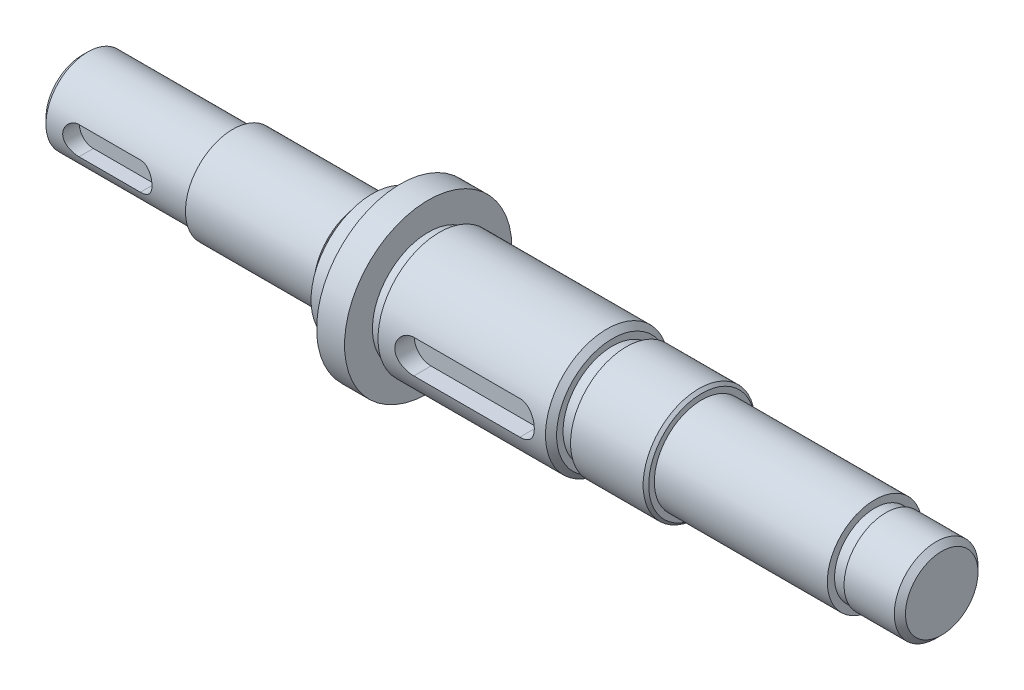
ISO-10303-21;
HEADER;
FILE_DESCRIPTION(('STEP AP214'),'2;1');
FILE_NAME('part.step','',(''),(''),'','','');
FILE_SCHEMA(('AUTOMOTIVE_DESIGN { 1 0 10303 214 1 1 1 1 }'));
ENDSEC;
DATA;
#1=APPLICATION_CONTEXT('core data for automotive mechanical design processes');
#2=APPLICATION_PROTOCOL_DEFINITION('international standard','automotive_design',2000,#1);
#3=PRODUCT_CONTEXT('',#1,'mechanical');
#4=PRODUCT('Part','Part','',(#3));
#5=PRODUCT_RELATED_PRODUCT_CATEGORY('part','',(#4));
#6=PRODUCT_DEFINITION_FORMATION('','',#4);
#7=PRODUCT_DEFINITION_CONTEXT('part definition',#1,'design');
#8=PRODUCT_DEFINITION('design','',#6,#7);
#9=PRODUCT_DEFINITION_SHAPE('','',#8);
#10=(LENGTH_UNIT() NAMED_UNIT(*) SI_UNIT(.MILLI.,.METRE.));
#11=(NAMED_UNIT(*) PLANE_ANGLE_UNIT() SI_UNIT($,.RADIAN.));
#12=(NAMED_UNIT(*) SI_UNIT($,.STERADIAN.) SOLID_ANGLE_UNIT());
#13=UNCERTAINTY_MEASURE_WITH_UNIT(LENGTH_MEASURE(1.E-05),#10,'distance_accuracy_value','');
#14=(GEOMETRIC_REPRESENTATION_CONTEXT(3) GLOBAL_UNCERTAINTY_ASSIGNED_CONTEXT((#13)) GLOBAL_UNIT_ASSIGNED_CONTEXT((#10,
#11,#12)) REPRESENTATION_CONTEXT('',''));
#15=CARTESIAN_POINT('',(0.,0.,0.));
#16=DIRECTION('',(0.,0.,1.));
#17=DIRECTION('',(1.,0.,0.));
#18=AXIS2_PLACEMENT_3D('',#15,#16,#17);
#19=CARTESIAN_POINT('',(142.,0.,0.));
#20=DIRECTION('',(1.,0.,0.));
#21=DIRECTION('',(0.,0.,-1.));
#22=AXIS2_PLACEMENT_3D('',#19,#20,#21);
#23=PLANE('',#22);
#24=CARTESIAN_POINT('',(142.,0.,0.));
#25=DIRECTION('',(1.,0.,0.));
#26=DIRECTION('',(0.,0.,-1.));
#27=AXIS2_PLACEMENT_3D('',#24,#25,#26);
#28=CIRCLE('',#27,8.5);
#29=CARTESIAN_POINT('',(142.,0.,-8.5));
#30=VERTEX_POINT('',#29);
#31=EDGE_CURVE('E159',#30,#30,#28,.T.);
#32=ORIENTED_EDGE('',*,*,#31,.T.);
#33=EDGE_LOOP('',(#32));
#34=FACE_BOUND('',#33,.T.);
#35=CARTESIAN_POINT('',(142.,0.,0.));
#36=DIRECTION('',(1.,0.,0.));
#37=DIRECTION('',(0.,0.,-1.));
#38=AXIS2_PLACEMENT_3D('',#35,#36,#37);
#39=CIRCLE('',#38,7.2);
#40=CARTESIAN_POINT('',(142.,0.,-7.2));
#41=VERTEX_POINT('',#40);
#42=EDGE_CURVE('E152',#41,#41,#39,.T.);
#43=ORIENTED_EDGE('',*,*,#42,.F.);
#44=EDGE_LOOP('',(#43));
#45=FACE_BOUND('',#44,.T.);
#46=ADVANCED_FACE('F30',(#34,#45),#23,.T.);
#47=CARTESIAN_POINT('',(111.,0.,0.));
#48=DIRECTION('',(1.,0.,0.));
#49=DIRECTION('',(0.,0.,-1.));
#50=AXIS2_PLACEMENT_3D('',#47,#48,#49);
#51=PLANE('',#50);
#52=CARTESIAN_POINT('',(111.,0.,0.));
#53=DIRECTION('',(1.,0.,0.));
#54=DIRECTION('',(0.,0.,-1.));
#55=AXIS2_PLACEMENT_3D('',#52,#53,#54);
#56=CIRCLE('',#55,9.50000000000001);
#57=CARTESIAN_POINT('',(111.,0.,-9.50000000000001));
#58=VERTEX_POINT('',#57);
#59=EDGE_CURVE('E352',#58,#58,#56,.T.);
#60=ORIENTED_EDGE('',*,*,#59,.T.);
#61=EDGE_LOOP('',(#60));
#62=FACE_BOUND('',#61,.T.);
#63=CARTESIAN_POINT('',(111.,0.,0.));
#64=DIRECTION('',(1.,0.,0.));
#65=DIRECTION('',(0.,0.,-1.));
#66=AXIS2_PLACEMENT_3D('',#63,#64,#65);
#67=CIRCLE('',#66,8.5);
#68=CARTESIAN_POINT('',(111.,0.,-8.5));
#69=VERTEX_POINT('',#68);
#70=EDGE_CURVE('E156',#69,#69,#67,.T.);
#71=ORIENTED_EDGE('',*,*,#70,.F.);
#72=EDGE_LOOP('',(#71));
#73=FACE_BOUND('',#72,.T.);
#74=ADVANCED_FACE('F261',(#62,#73),#51,.T.);
#75=CARTESIAN_POINT('',(95.,0.,0.));
#76=DIRECTION('',(1.,0.,0.));
#77=DIRECTION('',(0.,0.,-1.));
#78=AXIS2_PLACEMENT_3D('',#75,#76,#77);
#79=PLANE('',#78);
#80=CARTESIAN_POINT('',(95.,0.,0.));
#81=DIRECTION('',(1.,0.,0.));
#82=DIRECTION('',(0.,0.,-1.));
#83=AXIS2_PLACEMENT_3D('',#80,#81,#82);
#84=CIRCLE('',#83,9.99999999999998);
#85=CARTESIAN_POINT('',(95.,0.,-9.99999999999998));
#86=VERTEX_POINT('',#85);
#87=EDGE_CURVE('E346',#86,#86,#84,.T.);
#88=ORIENTED_EDGE('',*,*,#87,.T.);
#89=EDGE_LOOP('',(#88));
#90=FACE_BOUND('',#89,.T.);
#91=CARTESIAN_POINT('',(95.,0.,0.));
#92=DIRECTION('',(1.,0.,0.));
#93=DIRECTION('',(0.,0.,-1.));
#94=AXIS2_PLACEMENT_3D('',#91,#92,#93);
#95=CIRCLE('',#94,8.85);
#96=CARTESIAN_POINT('',(95.,0.,-8.85));
#97=VERTEX_POINT('',#96);
#98=EDGE_CURVE('E167',#97,#97,#95,.T.);
#99=ORIENTED_EDGE('',*,*,#98,.F.);
#100=EDGE_LOOP('',(#99));
#101=FACE_BOUND('',#100,.T.);
#102=ADVANCED_FACE('F269',(#90,#101),#79,.T.);
#103=CARTESIAN_POINT('',(62.,0.,0.));
#104=DIRECTION('',(1.,0.,0.));
#105=DIRECTION('',(0.,0.,-1.));
#106=AXIS2_PLACEMENT_3D('',#103,#104,#105);
#107=PLANE('',#106);
#108=CARTESIAN_POINT('',(62.,0.,0.));
#109=DIRECTION('',(1.,0.,0.));
#110=DIRECTION('',(0.,0.,-1.));
#111=AXIS2_PLACEMENT_3D('',#108,#109,#110);
#112=CIRCLE('',#111,15.);
#113=CARTESIAN_POINT('',(62.,0.,-15.));
#114=VERTEX_POINT('',#113);
#115=EDGE_CURVE('E183',#114,#114,#112,.T.);
#116=ORIENTED_EDGE('',*,*,#115,.T.);
#117=EDGE_LOOP('',(#116));
#118=FACE_BOUND('',#117,.T.);
#119=CARTESIAN_POINT('',(62.,0.,0.));
#120=DIRECTION('',(1.,0.,0.));
#121=DIRECTION('',(0.,0.,-1.));
#122=AXIS2_PLACEMENT_3D('',#119,#120,#121);
#123=CIRCLE('',#122,10.);
#124=CARTESIAN_POINT('',(62.,0.,-10.));
#125=VERTEX_POINT('',#124);
#126=EDGE_CURVE('E176',#125,#125,#123,.T.);
#127=ORIENTED_EDGE('',*,*,#126,.F.);
#128=EDGE_LOOP('',(#127));
#129=FACE_BOUND('',#128,.T.);
#130=ADVANCED_FACE('F285',(#118,#129),#107,.T.);
#131=CARTESIAN_POINT('',(50.,0.,0.));
#132=DIRECTION('',(1.,0.,0.));
#133=DIRECTION('',(0.,0.,-1.));
#134=AXIS2_PLACEMENT_3D('',#131,#132,#133);
#135=PLANE('',#134);
#136=CARTESIAN_POINT('',(50.,0.,0.));
#137=DIRECTION('',(1.,0.,0.));
#138=DIRECTION('',(0.,0.,-1.));
#139=AXIS2_PLACEMENT_3D('',#136,#137,#138);
#140=CIRCLE('',#139,8.5);
#141=CARTESIAN_POINT('',(50.,0.,-8.5));
#142=VERTEX_POINT('',#141);
#143=EDGE_CURVE('E201',#142,#142,#140,.T.);
#144=ORIENTED_EDGE('',*,*,#143,.T.);
#145=EDGE_LOOP('',(#144));
#146=FACE_BOUND('',#145,.T.);
#147=CARTESIAN_POINT('',(50.,0.,0.));
#148=DIRECTION('',(1.,0.,0.));
#149=DIRECTION('',(0.,0.,-1.));
#150=AXIS2_PLACEMENT_3D('',#147,#148,#149);
#151=CIRCLE('',#150,8.2);
#152=CARTESIAN_POINT('',(50.,0.,-8.2));
#153=VERTEX_POINT('',#152);
#154=EDGE_CURVE('E192',#153,#153,#151,.T.);
#155=ORIENTED_EDGE('',*,*,#154,.F.);
#156=EDGE_LOOP('',(#155));
#157=FACE_BOUND('',#156,.T.);
#158=ADVANCED_FACE('F485',(#146,#157),#135,.T.);
#159=CARTESIAN_POINT('',(27.,0.,0.));
#160=DIRECTION('',(-1.,0.,0.));
#161=DIRECTION('',(0.,0.,1.));
#162=AXIS2_PLACEMENT_3D('',#159,#160,#161);
#163=CYLINDRICAL_SURFACE('',#162,7.5);
#164=CARTESIAN_POINT('',(0.99999999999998,0.,0.));
#165=DIRECTION('',(1.,0.,0.));
#166=DIRECTION('',(0.,0.,-1.));
#167=AXIS2_PLACEMENT_3D('',#164,#165,#166);
#168=CIRCLE('',#167,7.5);
#169=CARTESIAN_POINT('',(0.99999999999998,0.,-7.5));
#170=VERTEX_POINT('',#169);
#171=EDGE_CURVE('E332',#170,#170,#168,.T.);
#172=ORIENTED_EDGE('',*,*,#171,.T.);
#173=EDGE_LOOP('',(#172));
#174=FACE_BOUND('',#173,.T.);
#175=DIRECTION('',(-1.,0.,0.));
#176=VECTOR('',#175,1.);
#177=CARTESIAN_POINT('',(27.,2.5,7.07106781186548));
#178=LINE('',#177,#176);
#179=CARTESIAN_POINT('',(6.5,2.5,7.07106781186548));
#180=VERTEX_POINT('',#179);
#181=CARTESIAN_POINT('',(17.5,2.5,7.07106781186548));
#182=VERTEX_POINT('',#181);
#183=EDGE_CURVE('E330',#180,#182,#178,.F.);
#184=ORIENTED_EDGE('',*,*,#183,.T.);
#185=CARTESIAN_POINT('',(17.5,2.5,7.07106781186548));
#186=CARTESIAN_POINT('',(17.5682070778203,2.50000899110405,7.07105693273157));
#187=CARTESIAN_POINT('',(17.6364080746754,2.49720887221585,7.07205443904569));
#188=CARTESIAN_POINT('',(17.7722810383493,2.4860604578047,7.07598524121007));
#189=CARTESIAN_POINT('',(17.8399531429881,2.47771365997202,7.07891801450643));
#190=CARTESIAN_POINT('',(17.9740904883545,2.45557459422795,7.08662705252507));
#191=CARTESIAN_POINT('',(18.0405587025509,2.44179847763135,7.09139784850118));
#192=CARTESIAN_POINT('',(18.1720082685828,2.4089418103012,7.10262619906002));
#193=CARTESIAN_POINT('',(18.2369895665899,2.38986106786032,7.10908381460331));
#194=CARTESIAN_POINT('',(18.4289615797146,2.32491551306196,7.13069940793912));
#195=CARTESIAN_POINT('',(18.55317915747,2.2713141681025,7.14811243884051));
#196=CARTESIAN_POINT('',(18.7908768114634,2.14517784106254,7.1869703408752));
#197=CARTESIAN_POINT('',(18.9043502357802,2.07263123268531,7.20841768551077));
#198=CARTESIAN_POINT('',(19.1217929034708,1.90762995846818,7.25386182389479));
#199=CARTESIAN_POINT('',(19.2252851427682,1.81456284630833,7.27792189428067));
#200=CARTESIAN_POINT('',(19.4155171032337,1.61247071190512,7.32534626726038));
#201=CARTESIAN_POINT('',(19.502253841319,1.50344285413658,7.34871044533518));
#202=CARTESIAN_POINT('',(19.6586982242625,1.26900922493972,7.39284706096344));
#203=CARTESIAN_POINT('',(19.7279023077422,1.14325025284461,7.41353593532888));
#204=CARTESIAN_POINT('',(19.8439807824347,0.881073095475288,7.44924021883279));
#205=CARTESIAN_POINT('',(19.8908619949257,0.744658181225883,7.46425736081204));
#206=CARTESIAN_POINT('',(19.9593392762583,0.470073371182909,7.48647677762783));
#207=CARTESIAN_POINT('',(19.9817581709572,0.332129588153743,7.49393272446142));
#208=CARTESIAN_POINT('',(20.0032907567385,0.0542474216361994,7.50109021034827));
#209=CARTESIAN_POINT('',(20.0024100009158,-0.0856904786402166,7.50079359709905));
#210=CARTESIAN_POINT('',(19.9778892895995,-0.357759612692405,7.49265096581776));
#211=CARTESIAN_POINT('',(19.9551434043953,-0.489981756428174,7.48510152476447));
#212=CARTESIAN_POINT('',(19.8890170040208,-0.748610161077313,7.46367401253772));
#213=CARTESIAN_POINT('',(19.8456353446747,-0.875016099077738,7.44979559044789));
#214=CARTESIAN_POINT('',(19.7389465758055,-1.12038155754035,7.41689170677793));
#215=CARTESIAN_POINT('',(19.6753848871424,-1.23922126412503,7.39780094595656));
#216=CARTESIAN_POINT('',(19.530350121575,-1.46481147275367,7.35645969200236));
#217=CARTESIAN_POINT('',(19.4488721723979,-1.57155867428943,7.33420833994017));
#218=CARTESIAN_POINT('',(19.2658223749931,-1.77524334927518,7.28765679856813));
#219=CARTESIAN_POINT('',(19.1634861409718,-1.87148402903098,7.26330946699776));
#220=CARTESIAN_POINT('',(18.9438962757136,-2.04568006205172,7.21618726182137));
#221=CARTESIAN_POINT('',(18.826637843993,-2.12362950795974,7.19341289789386));
#222=CARTESIAN_POINT('',(18.5782995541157,-2.26000831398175,7.15175078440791));
#223=CARTESIAN_POINT('',(18.4470412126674,-2.31813252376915,7.13292537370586));
#224=CARTESIAN_POINT('',(18.1758825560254,-2.41115057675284,7.10202742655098));
#225=CARTESIAN_POINT('',(18.0359962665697,-2.4460810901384,7.08994423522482));
#226=CARTESIAN_POINT('',(17.82895340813,-2.47914539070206,7.078413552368));
#227=CARTESIAN_POINT('',(17.7633965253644,-2.48696265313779,7.07566669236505));
#228=CARTESIAN_POINT('',(17.6319048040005,-2.49738654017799,7.07199258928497));
#229=CARTESIAN_POINT('',(17.565970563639,-2.49999988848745,7.0710629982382));
#230=CARTESIAN_POINT('',(17.5,-2.5,7.07106781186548));
#231=B_SPLINE_CURVE_WITH_KNOTS('',3,(#185,#186,#187,#188,#189,#190,#191,#192,#193,#194,#195,
#196,#197,#198,#199,#200,#201,#202,#203,#204,#205,#206,#207,#208,#209,#210,#211,#212,#213,#214,
#215,#216,#217,#218,#219,#220,#221,#222,#223,#224,#225,#226,#227,#228,#229,#230),.UNSPECIFIED.,
.F.,.F.,(4,2,2,2,2,2,2,2,2,2,2,2,2,2,2,2,2,2,2,2,2,2,4),(0.,0.204546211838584,0.409037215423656,
0.612924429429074,0.816819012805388,1.22401016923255,1.63145179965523,2.05327864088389,
2.47518051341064,2.90809434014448,3.34087579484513,3.75860278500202,4.17623021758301,
4.57747647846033,4.97874498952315,5.38529148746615,5.79194868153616,6.21771736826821,
6.64362337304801,7.07581676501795,7.50732520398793,7.70536340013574,7.90314555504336),.UNSPECIFIED.);
#232=CARTESIAN_POINT('',(17.5,-2.5,7.07106781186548));
#233=VERTEX_POINT('',#232);
#234=EDGE_CURVE('E209',#182,#233,#231,.T.);
#235=ORIENTED_EDGE('',*,*,#234,.T.);
#236=DIRECTION('',(-1.,0.,0.));
#237=VECTOR('',#236,1.);
#238=CARTESIAN_POINT('',(27.,-2.5,7.07106781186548));
#239=LINE('',#238,#237);
#240=CARTESIAN_POINT('',(6.5,-2.5,7.07106781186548));
#241=VERTEX_POINT('',#240);
#242=EDGE_CURVE('E327',#233,#241,#239,.T.);
#243=ORIENTED_EDGE('',*,*,#242,.T.);
#244=CARTESIAN_POINT('',(6.5,-2.5,7.07106781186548));
#245=CARTESIAN_POINT('',(6.43179292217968,-2.50000899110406,7.07105693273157));
#246=CARTESIAN_POINT('',(6.36359192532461,-2.49720887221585,7.07205443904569));
#247=CARTESIAN_POINT('',(6.22771896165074,-2.4860604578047,7.07598524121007));
#248=CARTESIAN_POINT('',(6.16004685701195,-2.47771365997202,7.07891801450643));
#249=CARTESIAN_POINT('',(6.02590951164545,-2.45557459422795,7.08662705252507));
#250=CARTESIAN_POINT('',(5.95944129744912,-2.44179847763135,7.09139784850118));
#251=CARTESIAN_POINT('',(5.82799173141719,-2.4089418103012,7.10262619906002));
#252=CARTESIAN_POINT('',(5.7630104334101,-2.38986106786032,7.10908381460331));
#253=CARTESIAN_POINT('',(5.57103842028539,-2.32491551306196,7.13069940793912));
#254=CARTESIAN_POINT('',(5.44682084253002,-2.2713141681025,7.14811243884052));
#255=CARTESIAN_POINT('',(5.20912318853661,-2.14517784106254,7.1869703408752));
#256=CARTESIAN_POINT('',(5.09564976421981,-2.07263123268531,7.20841768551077));
#257=CARTESIAN_POINT('',(4.8782070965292,-1.90762995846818,7.25386182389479));
#258=CARTESIAN_POINT('',(4.7747148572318,-1.81456284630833,7.27792189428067));
#259=CARTESIAN_POINT('',(4.58448289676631,-1.61247071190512,7.32534626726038));
#260=CARTESIAN_POINT('',(4.497746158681,-1.50344285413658,7.34871044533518));
#261=CARTESIAN_POINT('',(4.34130177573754,-1.26900922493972,7.39284706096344));
#262=CARTESIAN_POINT('',(4.27209769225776,-1.1432502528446,7.41353593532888));
#263=CARTESIAN_POINT('',(4.1560192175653,-0.881073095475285,7.44924021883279));
#264=CARTESIAN_POINT('',(4.10913800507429,-0.744658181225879,7.46425736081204));
#265=CARTESIAN_POINT('',(4.04066072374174,-0.470073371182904,7.48647677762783));
#266=CARTESIAN_POINT('',(4.01824182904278,-0.332129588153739,7.49393272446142));
#267=CARTESIAN_POINT('',(3.99670924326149,-0.0542474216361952,7.50109021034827));
#268=CARTESIAN_POINT('',(3.99758999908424,0.0856904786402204,7.50079359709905));
#269=CARTESIAN_POINT('',(4.0221107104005,0.357759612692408,7.49265096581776));
#270=CARTESIAN_POINT('',(4.04485659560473,0.489981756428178,7.48510152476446));
#271=CARTESIAN_POINT('',(4.11098299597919,0.748610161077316,7.46367401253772));
#272=CARTESIAN_POINT('',(4.15436465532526,0.875016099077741,7.44979559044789));
#273=CARTESIAN_POINT('',(4.26105342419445,1.12038155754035,7.41689170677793));
#274=CARTESIAN_POINT('',(4.32461511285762,1.23922126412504,7.39780094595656));
#275=CARTESIAN_POINT('',(4.46964987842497,1.46481147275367,7.35645969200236));
#276=CARTESIAN_POINT('',(4.55112782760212,1.57155867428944,7.33420833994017));
#277=CARTESIAN_POINT('',(4.73417762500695,1.77524334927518,7.28765679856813));
#278=CARTESIAN_POINT('',(4.83651385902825,1.87148402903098,7.26330946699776));
#279=CARTESIAN_POINT('',(5.05610372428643,2.04568006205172,7.21618726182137));
#280=CARTESIAN_POINT('',(5.17336215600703,2.12362950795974,7.19341289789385));
#281=CARTESIAN_POINT('',(5.42170044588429,2.26000831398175,7.15175078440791));
#282=CARTESIAN_POINT('',(5.55295878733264,2.31813252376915,7.13292537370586));
#283=CARTESIAN_POINT('',(5.8241174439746,2.41115057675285,7.10202742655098));
#284=CARTESIAN_POINT('',(5.96400373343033,2.4460810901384,7.08994423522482));
#285=CARTESIAN_POINT('',(6.17104659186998,2.47914539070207,7.078413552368));
#286=CARTESIAN_POINT('',(6.23660347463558,2.48696265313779,7.07566669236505));
#287=CARTESIAN_POINT('',(6.36809519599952,2.49738654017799,7.07199258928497));
#288=CARTESIAN_POINT('',(6.43402943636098,2.49999988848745,7.0710629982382));
#289=CARTESIAN_POINT('',(6.5,2.5,7.07106781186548));
#290=B_SPLINE_CURVE_WITH_KNOTS('',3,(#244,#245,#246,#247,#248,#249,#250,#251,#252,#253,#254,
#255,#256,#257,#258,#259,#260,#261,#262,#263,#264,#265,#266,#267,#268,#269,#270,#271,#272,#273,
#274,#275,#276,#277,#278,#279,#280,#281,#282,#283,#284,#285,#286,#287,#288,#289),.UNSPECIFIED.,
.F.,.F.,(4,2,2,2,2,2,2,2,2,2,2,2,2,2,2,2,2,2,2,2,2,2,4),(0.,0.204546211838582,0.409037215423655,
0.612924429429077,0.816819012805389,1.22401016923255,1.63145179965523,2.0532786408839,
2.47518051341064,2.90809434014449,3.34087579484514,3.75860278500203,4.17623021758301,
4.57747647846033,4.97874498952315,5.38529148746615,5.79194868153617,6.21771736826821,
6.64362337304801,7.07581676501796,7.50732520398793,7.70536340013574,7.90314555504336),.UNSPECIFIED.);
#291=EDGE_CURVE('E53',#241,#180,#290,.T.);
#292=ORIENTED_EDGE('',*,*,#291,.T.);
#293=EDGE_LOOP('',(#184,#235,#243,#292));
#294=FACE_BOUND('',#293,.T.);
#295=CARTESIAN_POINT('',(27.,0.,0.));
#296=DIRECTION('',(1.,0.,0.));
#297=DIRECTION('',(0.,0.,-1.));
#298=AXIS2_PLACEMENT_3D('',#295,#296,#297);
#299=CIRCLE('',#298,7.5);
#300=CARTESIAN_POINT('',(27.,0.,-7.5));
#301=VERTEX_POINT('',#300);
#302=EDGE_CURVE('E204',#301,#301,#299,.T.);
#303=ORIENTED_EDGE('',*,*,#302,.F.);
#304=EDGE_LOOP('',(#303));
#305=FACE_BOUND('',#304,.T.);
#306=ADVANCED_FACE('F222',(#174,#294,#305),#163,.T.);
#307=CARTESIAN_POINT('',(0.,0.,0.));
#308=DIRECTION('',(1.,0.,0.));
#309=DIRECTION('',(0.,0.,-1.));
#310=AXIS2_PLACEMENT_3D('',#307,#308,#309);
#311=PLANE('',#310);
#312=CARTESIAN_POINT('',(0.,0.,0.));
#313=DIRECTION('',(1.,0.,0.));
#314=DIRECTION('',(0.,0.,-1.));
#315=AXIS2_PLACEMENT_3D('',#312,#313,#314);
#316=CIRCLE('',#315,6.50000000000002);
#317=CARTESIAN_POINT('',(0.,0.,-6.50000000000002));
#318=VERTEX_POINT('',#317);
#319=EDGE_CURVE('E335',#318,#318,#316,.F.);
#320=ORIENTED_EDGE('',*,*,#319,.T.);
#321=EDGE_LOOP('',(#320));
#322=FACE_BOUND('',#321,.T.);
#323=ADVANCED_FACE('F470',(#322),#311,.F.);
#324=CARTESIAN_POINT('',(27.,0.,0.));
#325=DIRECTION('',(1.,0.,0.));
#326=DIRECTION('',(0.,0.,-1.));
#327=AXIS2_PLACEMENT_3D('',#324,#325,#326);
#328=PLANE('',#327);
#329=CARTESIAN_POINT('',(27.,0.,0.));
#330=DIRECTION('',(1.,0.,0.));
#331=DIRECTION('',(0.,0.,-1.));
#332=AXIS2_PLACEMENT_3D('',#329,#330,#331);
#333=CIRCLE('',#332,8.5);
#334=CARTESIAN_POINT('',(27.,0.,-8.5));
#335=VERTEX_POINT('',#334);
#336=EDGE_CURVE('E198',#335,#335,#333,.T.);
#337=ORIENTED_EDGE('',*,*,#336,.F.);
#338=EDGE_LOOP('',(#337));
#339=FACE_BOUND('',#338,.T.);
#340=ORIENTED_EDGE('',*,*,#302,.T.);
#341=EDGE_LOOP('',(#340));
#342=FACE_BOUND('',#341,.T.);
#343=ADVANCED_FACE('F475',(#339,#342),#328,.F.);
#344=CARTESIAN_POINT('',(50.,0.,0.));
#345=DIRECTION('',(-1.,0.,0.));
#346=DIRECTION('',(0.,0.,1.));
#347=AXIS2_PLACEMENT_3D('',#344,#345,#346);
#348=CYLINDRICAL_SURFACE('',#347,8.5);
#349=ORIENTED_EDGE('',*,*,#143,.F.);
#350=EDGE_LOOP('',(#349));
#351=FACE_BOUND('',#350,.T.);
#352=ORIENTED_EDGE('',*,*,#336,.T.);
#353=EDGE_LOOP('',(#352));
#354=FACE_BOUND('',#353,.T.);
#355=ADVANCED_FACE('F616',(#351,#354),#348,.T.);
#356=CARTESIAN_POINT('',(52.,0.,0.));
#357=DIRECTION('',(-1.,0.,0.));
#358=DIRECTION('',(0.,0.,1.));
#359=AXIS2_PLACEMENT_3D('',#356,#357,#358);
#360=CYLINDRICAL_SURFACE('',#359,8.2);
#361=CARTESIAN_POINT('',(52.,0.,0.));
#362=DIRECTION('',(1.,0.,0.));
#363=DIRECTION('',(0.,0.,-1.));
#364=AXIS2_PLACEMENT_3D('',#361,#362,#363);
#365=CIRCLE('',#364,8.2);
#366=CARTESIAN_POINT('',(52.,0.,-8.2));
#367=VERTEX_POINT('',#366);
#368=EDGE_CURVE('E195',#367,#367,#365,.T.);
#369=ORIENTED_EDGE('',*,*,#368,.F.);
#370=EDGE_LOOP('',(#369));
#371=FACE_BOUND('',#370,.T.);
#372=ORIENTED_EDGE('',*,*,#154,.T.);
#373=EDGE_LOOP('',(#372));
#374=FACE_BOUND('',#373,.T.);
#375=ADVANCED_FACE('F606',(#371,#374),#360,.T.);
#376=CARTESIAN_POINT('',(52.,0.,0.));
#377=DIRECTION('',(1.,0.,0.));
#378=DIRECTION('',(0.,0.,-1.));
#379=AXIS2_PLACEMENT_3D('',#376,#377,#378);
#380=PLANE('',#379);
#381=CARTESIAN_POINT('',(52.,0.,0.));
#382=DIRECTION('',(1.,0.,0.));
#383=DIRECTION('',(0.,0.,-1.));
#384=AXIS2_PLACEMENT_3D('',#381,#382,#383);
#385=CIRCLE('',#384,11.);
#386=CARTESIAN_POINT('',(52.,0.,-11.));
#387=VERTEX_POINT('',#386);
#388=EDGE_CURVE('E186',#387,#387,#385,.T.);
#389=ORIENTED_EDGE('',*,*,#388,.F.);
#390=EDGE_LOOP('',(#389));
#391=FACE_BOUND('',#390,.T.);
#392=ORIENTED_EDGE('',*,*,#368,.T.);
#393=EDGE_LOOP('',(#392));
#394=FACE_BOUND('',#393,.T.);
#395=ADVANCED_FACE('F596',(#391,#394),#380,.F.);
#396=CARTESIAN_POINT('',(57.,0.,0.));
#397=DIRECTION('',(-1.,0.,0.));
#398=DIRECTION('',(0.,0.,1.));
#399=AXIS2_PLACEMENT_3D('',#396,#397,#398);
#400=CYLINDRICAL_SURFACE('',#399,11.);
#401=CARTESIAN_POINT('',(57.,0.,0.));
#402=DIRECTION('',(1.,0.,0.));
#403=DIRECTION('',(0.,0.,-1.));
#404=AXIS2_PLACEMENT_3D('',#401,#402,#403);
#405=CIRCLE('',#404,11.);
#406=CARTESIAN_POINT('',(57.,0.,-11.));
#407=VERTEX_POINT('',#406);
#408=EDGE_CURVE('E189',#407,#407,#405,.T.);
#409=ORIENTED_EDGE('',*,*,#408,.F.);
#410=EDGE_LOOP('',(#409));
#411=FACE_BOUND('',#410,.T.);
#412=ORIENTED_EDGE('',*,*,#388,.T.);
#413=EDGE_LOOP('',(#412));
#414=FACE_BOUND('',#413,.T.);
#415=ADVANCED_FACE('F586',(#411,#414),#400,.T.);
#416=CARTESIAN_POINT('',(57.,0.,0.));
#417=DIRECTION('',(1.,0.,0.));
#418=DIRECTION('',(0.,0.,-1.));
#419=AXIS2_PLACEMENT_3D('',#416,#417,#418);
#420=PLANE('',#419);
#421=CARTESIAN_POINT('',(57.,0.,0.));
#422=DIRECTION('',(1.,0.,0.));
#423=DIRECTION('',(0.,0.,-1.));
#424=AXIS2_PLACEMENT_3D('',#421,#422,#423);
#425=CIRCLE('',#424,15.);
#426=CARTESIAN_POINT('',(57.,0.,-15.));
#427=VERTEX_POINT('',#426);
#428=EDGE_CURVE('E180',#427,#427,#425,.T.);
#429=ORIENTED_EDGE('',*,*,#428,.F.);
#430=EDGE_LOOP('',(#429));
#431=FACE_BOUND('',#430,.T.);
#432=ORIENTED_EDGE('',*,*,#408,.T.);
#433=EDGE_LOOP('',(#432));
#434=FACE_BOUND('',#433,.T.);
#435=ADVANCED_FACE('F576',(#431,#434),#420,.F.);
#436=CARTESIAN_POINT('',(62.,0.,0.));
#437=DIRECTION('',(-1.,0.,0.));
#438=DIRECTION('',(0.,0.,1.));
#439=AXIS2_PLACEMENT_3D('',#436,#437,#438);
#440=CYLINDRICAL_SURFACE('',#439,15.);
#441=ORIENTED_EDGE('',*,*,#115,.F.);
#442=EDGE_LOOP('',(#441));
#443=FACE_BOUND('',#442,.T.);
#444=ORIENTED_EDGE('',*,*,#428,.T.);
#445=EDGE_LOOP('',(#444));
#446=FACE_BOUND('',#445,.T.);
#447=ADVANCED_FACE('F560',(#443,#446),#440,.T.);
#448=CARTESIAN_POINT('',(64.,0.,0.));
#449=DIRECTION('',(-1.,0.,0.));
#450=DIRECTION('',(0.,0.,1.));
#451=AXIS2_PLACEMENT_3D('',#448,#449,#450);
#452=CYLINDRICAL_SURFACE('',#451,10.);
#453=CARTESIAN_POINT('',(64.,0.,0.));
#454=DIRECTION('',(1.,0.,0.));
#455=DIRECTION('',(0.,0.,-1.));
#456=AXIS2_PLACEMENT_3D('',#453,#454,#455);
#457=CIRCLE('',#456,10.);
#458=CARTESIAN_POINT('',(64.,0.,-10.));
#459=VERTEX_POINT('',#458);
#460=EDGE_CURVE('E177',#459,#459,#457,.T.);
#461=ORIENTED_EDGE('',*,*,#460,.F.);
#462=EDGE_LOOP('',(#461));
#463=FACE_BOUND('',#462,.T.);
#464=ORIENTED_EDGE('',*,*,#126,.T.);
#465=EDGE_LOOP('',(#464));
#466=FACE_BOUND('',#465,.T.);
#467=ADVANCED_FACE('F290',(#463,#466),#452,.T.);
#468=CARTESIAN_POINT('',(64.,0.,0.));
#469=DIRECTION('',(1.,0.,0.));
#470=DIRECTION('',(0.,0.,-1.));
#471=AXIS2_PLACEMENT_3D('',#468,#469,#470);
#472=PLANE('',#471);
#473=CARTESIAN_POINT('',(64.,0.,0.));
#474=DIRECTION('',(1.,0.,0.));
#475=DIRECTION('',(0.,0.,-1.));
#476=AXIS2_PLACEMENT_3D('',#473,#474,#475);
#477=CIRCLE('',#476,11.);
#478=CARTESIAN_POINT('',(64.,0.,-11.));
#479=VERTEX_POINT('',#478);
#480=EDGE_CURVE('E171',#479,#479,#477,.T.);
#481=ORIENTED_EDGE('',*,*,#480,.F.);
#482=EDGE_LOOP('',(#481));
#483=FACE_BOUND('',#482,.T.);
#484=ORIENTED_EDGE('',*,*,#460,.T.);
#485=EDGE_LOOP('',(#484));
#486=FACE_BOUND('',#485,.T.);
#487=ADVANCED_FACE('F287',(#483,#486),#472,.F.);
#488=CARTESIAN_POINT('',(95.,0.,0.));
#489=DIRECTION('',(-1.,0.,0.));
#490=DIRECTION('',(0.,0.,1.));
#491=AXIS2_PLACEMENT_3D('',#488,#489,#490);
#492=CYLINDRICAL_SURFACE('',#491,11.);
#493=DIRECTION('',(-1.,0.,0.));
#494=VECTOR('',#493,1.);
#495=CARTESIAN_POINT('',(95.,3.00000000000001,10.5830052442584));
#496=LINE('',#495,#494);
#497=CARTESIAN_POINT('',(70.,3.00000000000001,10.5830052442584));
#498=VERTEX_POINT('',#497);
#499=CARTESIAN_POINT('',(89.,3.00000000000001,10.5830052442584));
#500=VERTEX_POINT('',#499);
#501=EDGE_CURVE('E11',#498,#500,#496,.F.);
#502=ORIENTED_EDGE('',*,*,#501,.T.);
#503=CARTESIAN_POINT('',(89.,3.00000000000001,10.5830052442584));
#504=CARTESIAN_POINT('',(89.0826938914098,3.0000098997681,10.5829949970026));
#505=CARTESIAN_POINT('',(89.165381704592,2.99658102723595,10.5839742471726));
#506=CARTESIAN_POINT('',(89.3301335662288,2.98292268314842,10.5878356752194));
#507=CARTESIAN_POINT('',(89.4121977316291,2.97269452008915,10.5907174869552));
#508=CARTESIAN_POINT('',(89.5749425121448,2.94554459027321,10.598299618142));
#509=CARTESIAN_POINT('',(89.6556257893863,2.92863770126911,10.6029958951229));
#510=CARTESIAN_POINT('',(89.8152032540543,2.8882912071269,10.6140571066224));
#511=CARTESIAN_POINT('',(89.8940974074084,2.8648514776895,10.6204220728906));
#512=CARTESIAN_POINT('',(90.127242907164,2.78500332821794,10.6417494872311));
#513=CARTESIAN_POINT('',(90.2781393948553,2.71903526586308,10.6589535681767));
#514=CARTESIAN_POINT('',(90.5667053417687,2.56365897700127,10.6973836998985));
#515=CARTESIAN_POINT('',(90.704370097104,2.47424245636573,10.7186111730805));
#516=CARTESIAN_POINT('',(90.9662097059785,2.27200424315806,10.7633148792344));
#517=CARTESIAN_POINT('',(91.0899918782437,2.15868225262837,10.7868322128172));
#518=CARTESIAN_POINT('',(91.3170514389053,1.91292298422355,10.8331129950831));
#519=CARTESIAN_POINT('',(91.4203254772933,1.78048258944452,10.8558763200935));
#520=CARTESIAN_POINT('',(91.6050989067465,1.49749198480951,10.8985459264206));
#521=CARTESIAN_POINT('',(91.686203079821,1.34667477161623,10.9183977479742));
#522=CARTESIAN_POINT('',(91.8217484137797,1.03291980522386,10.9525311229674));
#523=CARTESIAN_POINT('',(91.8761955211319,0.869984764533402,10.9668139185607));
#524=CARTESIAN_POINT('',(91.9556017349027,0.540744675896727,10.9879090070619));
#525=CARTESIAN_POINT('',(91.9812343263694,0.374613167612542,10.9948916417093));
#526=CARTESIAN_POINT('',(92.004404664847,0.0402673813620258,11.0011960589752));
#527=CARTESIAN_POINT('',(92.0019467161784,-0.127946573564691,11.0005190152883));
#528=CARTESIAN_POINT('',(91.9694751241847,-0.456980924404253,10.9917041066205));
#529=CARTESIAN_POINT('',(91.9401899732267,-0.617879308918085,10.9837634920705));
#530=CARTESIAN_POINT('',(91.8560747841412,-0.932383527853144,10.9615477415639));
#531=CARTESIAN_POINT('',(91.8012435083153,-1.08598900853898,10.9472722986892));
#532=CARTESIAN_POINT('',(91.667045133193,-1.38338788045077,10.9137016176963));
#533=CARTESIAN_POINT('',(91.5874317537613,-1.52706425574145,10.8943563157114));
#534=CARTESIAN_POINT('',(91.4061201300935,-1.79926098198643,10.8527253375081));
#535=CARTESIAN_POINT('',(91.3044178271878,-1.92777854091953,10.830439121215));
#536=CARTESIAN_POINT('',(91.0779767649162,-2.17034844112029,10.7844948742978));
#537=CARTESIAN_POINT('',(90.952605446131,-2.28380693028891,10.760815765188));
#538=CARTESIAN_POINT('',(90.6843376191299,-2.48826234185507,10.7153886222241));
#539=CARTESIAN_POINT('',(90.541436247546,-2.57925300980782,10.6936411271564));
#540=CARTESIAN_POINT('',(90.240805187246,-2.73667910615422,10.6544469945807));
#541=CARTESIAN_POINT('',(90.0829757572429,-2.80293223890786,10.6370325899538));
#542=CARTESIAN_POINT('',(89.757912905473,-2.90768324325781,10.6088816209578));
#543=CARTESIAN_POINT('',(89.5906940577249,-2.9462229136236,10.598135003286));
#544=CARTESIAN_POINT('',(89.3516455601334,-2.98015870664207,10.588613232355));
#545=CARTESIAN_POINT('',(89.2814835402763,-2.98759962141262,10.5865140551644));
#546=CARTESIAN_POINT('',(89.1408924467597,-2.99751512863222,10.58371035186));
#547=CARTESIAN_POINT('',(89.0704639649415,-2.99999749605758,10.5830036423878));
#548=CARTESIAN_POINT('',(89.,-3.00000000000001,10.5830052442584));
#549=B_SPLINE_CURVE_WITH_KNOTS('',3,(#503,#504,#505,#506,#507,#508,#509,#510,#511,#512,#513,
#514,#515,#516,#517,#518,#519,#520,#521,#522,#523,#524,#525,#526,#527,#528,#529,#530,#531,#532,
#533,#534,#535,#536,#537,#538,#539,#540,#541,#542,#543,#544,#545,#546,#547,#548),.UNSPECIFIED.,
.F.,.F.,(4,2,2,2,2,2,2,2,2,2,2,2,2,2,2,2,2,2,2,2,2,2,4),(0.,0.247994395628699,0.495941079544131,
0.743338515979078,0.99074065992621,1.48499724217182,1.97942888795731,2.4854708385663,
2.99159538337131,3.50622794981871,4.02074566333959,4.52296979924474,5.0251169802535,
5.51402000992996,6.00294672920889,6.4968964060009,6.99093691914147,7.50077286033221,
8.01075056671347,8.52441550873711,9.03730408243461,9.24891043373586,9.46018472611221),.UNSPECIFIED.);
#550=CARTESIAN_POINT('',(89.,-3.00000000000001,10.5830052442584));
#551=VERTEX_POINT('',#550);
#552=EDGE_CURVE('E299',#500,#551,#549,.T.);
#553=ORIENTED_EDGE('',*,*,#552,.T.);
#554=DIRECTION('',(-1.,0.,0.));
#555=VECTOR('',#554,1.);
#556=CARTESIAN_POINT('',(95.,-3.00000000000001,10.5830052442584));
#557=LINE('',#556,#555);
#558=CARTESIAN_POINT('',(70.,-3.00000000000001,10.5830052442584));
#559=VERTEX_POINT('',#558);
#560=EDGE_CURVE('E38',#551,#559,#557,.T.);
#561=ORIENTED_EDGE('',*,*,#560,.T.);
#562=CARTESIAN_POINT('',(70.,-3.00000000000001,10.5830052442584));
#563=CARTESIAN_POINT('',(69.9173061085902,-3.0000098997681,10.5829949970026));
#564=CARTESIAN_POINT('',(69.834618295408,-2.99658102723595,10.5839742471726));
#565=CARTESIAN_POINT('',(69.6698664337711,-2.98292268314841,10.5878356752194));
#566=CARTESIAN_POINT('',(69.5878022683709,-2.97269452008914,10.5907174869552));
#567=CARTESIAN_POINT('',(69.4250574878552,-2.94554459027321,10.598299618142));
#568=CARTESIAN_POINT('',(69.3443742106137,-2.92863770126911,10.6029958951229));
#569=CARTESIAN_POINT('',(69.1847967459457,-2.8882912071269,10.6140571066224));
#570=CARTESIAN_POINT('',(69.1059025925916,-2.8648514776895,10.6204220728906));
#571=CARTESIAN_POINT('',(68.872757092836,-2.78500332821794,10.6417494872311));
#572=CARTESIAN_POINT('',(68.7218606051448,-2.71903526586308,10.6589535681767));
#573=CARTESIAN_POINT('',(68.4332946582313,-2.56365897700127,10.6973836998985));
#574=CARTESIAN_POINT('',(68.295629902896,-2.47424245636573,10.7186111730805));
#575=CARTESIAN_POINT('',(68.0337902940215,-2.27200424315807,10.7633148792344));
#576=CARTESIAN_POINT('',(67.9100081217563,-2.15868225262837,10.7868322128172));
#577=CARTESIAN_POINT('',(67.6829485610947,-1.91292298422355,10.8331129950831));
#578=CARTESIAN_POINT('',(67.5796745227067,-1.78048258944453,10.8558763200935));
#579=CARTESIAN_POINT('',(67.3949010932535,-1.49749198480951,10.8985459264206));
#580=CARTESIAN_POINT('',(67.313796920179,-1.34667477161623,10.9183977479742));
#581=CARTESIAN_POINT('',(67.1782515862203,-1.03291980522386,10.9525311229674));
#582=CARTESIAN_POINT('',(67.1238044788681,-0.869984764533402,10.9668139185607));
#583=CARTESIAN_POINT('',(67.0443982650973,-0.540744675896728,10.9879090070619));
#584=CARTESIAN_POINT('',(67.0187656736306,-0.374613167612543,10.9948916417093));
#585=CARTESIAN_POINT('',(66.995595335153,-0.0402673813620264,11.0011960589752));
#586=CARTESIAN_POINT('',(66.9980532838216,0.127946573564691,11.0005190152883));
#587=CARTESIAN_POINT('',(67.0305248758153,0.456980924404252,10.9917041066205));
#588=CARTESIAN_POINT('',(67.0598100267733,0.617879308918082,10.9837634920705));
#589=CARTESIAN_POINT('',(67.1439252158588,0.932383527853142,10.9615477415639));
#590=CARTESIAN_POINT('',(67.1987564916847,1.08598900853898,10.9472722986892));
#591=CARTESIAN_POINT('',(67.332954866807,1.38338788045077,10.9137016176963));
#592=CARTESIAN_POINT('',(67.4125682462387,1.52706425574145,10.8943563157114));
#593=CARTESIAN_POINT('',(67.5938798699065,1.79926098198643,10.8527253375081));
#594=CARTESIAN_POINT('',(67.6955821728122,1.92777854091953,10.830439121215));
#595=CARTESIAN_POINT('',(67.9220232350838,2.17034844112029,10.7844948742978));
#596=CARTESIAN_POINT('',(68.047394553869,2.28380693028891,10.760815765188));
#597=CARTESIAN_POINT('',(68.3156623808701,2.48826234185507,10.7153886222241));
#598=CARTESIAN_POINT('',(68.458563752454,2.57925300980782,10.6936411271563));
#599=CARTESIAN_POINT('',(68.759194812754,2.73667910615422,10.6544469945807));
#600=CARTESIAN_POINT('',(68.9170242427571,2.80293223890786,10.6370325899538));
#601=CARTESIAN_POINT('',(69.242087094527,2.90768324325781,10.6088816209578));
#602=CARTESIAN_POINT('',(69.4093059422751,2.9462229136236,10.598135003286));
#603=CARTESIAN_POINT('',(69.6483544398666,2.98015870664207,10.588613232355));
#604=CARTESIAN_POINT('',(69.7185164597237,2.98759962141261,10.5865140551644));
#605=CARTESIAN_POINT('',(69.8591075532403,2.99751512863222,10.58371035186));
#606=CARTESIAN_POINT('',(69.9295360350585,2.99999749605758,10.5830036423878));
#607=CARTESIAN_POINT('',(70.,3.00000000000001,10.5830052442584));
#608=B_SPLINE_CURVE_WITH_KNOTS('',3,(#562,#563,#564,#565,#566,#567,#568,#569,#570,#571,#572,
#573,#574,#575,#576,#577,#578,#579,#580,#581,#582,#583,#584,#585,#586,#587,#588,#589,#590,#591,
#592,#593,#594,#595,#596,#597,#598,#599,#600,#601,#602,#603,#604,#605,#606,#607),.UNSPECIFIED.,
.F.,.F.,(4,2,2,2,2,2,2,2,2,2,2,2,2,2,2,2,2,2,2,2,2,2,4),(0.,0.247994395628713,0.495941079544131,
0.743338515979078,0.99074065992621,1.48499724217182,1.97942888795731,2.48547083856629,
2.99159538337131,3.50622794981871,4.02074566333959,4.52296979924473,5.0251169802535,
5.51402000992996,6.00294672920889,6.4968964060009,6.99093691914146,7.50077286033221,
8.01075056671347,8.5244155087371,9.03730408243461,9.24891043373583,9.46018472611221),.UNSPECIFIED.);
#609=EDGE_CURVE('E45',#559,#498,#608,.T.);
#610=ORIENTED_EDGE('',*,*,#609,.T.);
#611=EDGE_LOOP('',(#502,#553,#561,#610));
#612=FACE_BOUND('',#611,.T.);
#613=CARTESIAN_POINT('',(94.,0.,0.));
#614=DIRECTION('',(1.,0.,0.));
#615=DIRECTION('',(0.,0.,-1.));
#616=AXIS2_PLACEMENT_3D('',#613,#614,#615);
#617=CIRCLE('',#616,11.);
#618=CARTESIAN_POINT('',(94.,0.,-11.));
#619=VERTEX_POINT('',#618);
#620=EDGE_CURVE('E349',#619,#619,#617,.F.);
#621=ORIENTED_EDGE('',*,*,#620,.T.);
#622=EDGE_LOOP('',(#621));
#623=FACE_BOUND('',#622,.T.);
#624=ORIENTED_EDGE('',*,*,#480,.T.);
#625=EDGE_LOOP('',(#624));
#626=FACE_BOUND('',#625,.T.);
#627=ADVANCED_FACE('F281',(#612,#623,#626),#492,.T.);
#628=CARTESIAN_POINT('',(97.5,0.,0.));
#629=DIRECTION('',(-1.,0.,0.));
#630=DIRECTION('',(0.,0.,1.));
#631=AXIS2_PLACEMENT_3D('',#628,#629,#630);
#632=CYLINDRICAL_SURFACE('',#631,8.85);
#633=CARTESIAN_POINT('',(97.5,0.,0.));
#634=DIRECTION('',(1.,0.,0.));
#635=DIRECTION('',(0.,0.,-1.));
#636=AXIS2_PLACEMENT_3D('',#633,#634,#635);
#637=CIRCLE('',#636,8.85);
#638=CARTESIAN_POINT('',(97.5,0.,-8.85));
#639=VERTEX_POINT('',#638);
#640=EDGE_CURVE('E168',#639,#639,#637,.T.);
#641=ORIENTED_EDGE('',*,*,#640,.F.);
#642=EDGE_LOOP('',(#641));
#643=FACE_BOUND('',#642,.T.);
#644=ORIENTED_EDGE('',*,*,#98,.T.);
#645=EDGE_LOOP('',(#644));
#646=FACE_BOUND('',#645,.T.);
#647=ADVANCED_FACE('F274',(#643,#646),#632,.T.);
#648=CARTESIAN_POINT('',(97.5,0.,0.));
#649=DIRECTION('',(1.,0.,0.));
#650=DIRECTION('',(0.,0.,-1.));
#651=AXIS2_PLACEMENT_3D('',#648,#649,#650);
#652=PLANE('',#651);
#653=CARTESIAN_POINT('',(97.5,0.,0.));
#654=DIRECTION('',(1.,0.,0.));
#655=DIRECTION('',(0.,0.,-1.));
#656=AXIS2_PLACEMENT_3D('',#653,#654,#655);
#657=CIRCLE('',#656,10.);
#658=CARTESIAN_POINT('',(97.5,0.,-10.));
#659=VERTEX_POINT('',#658);
#660=EDGE_CURVE('E162',#659,#659,#657,.T.);
#661=ORIENTED_EDGE('',*,*,#660,.F.);
#662=EDGE_LOOP('',(#661));
#663=FACE_BOUND('',#662,.T.);
#664=ORIENTED_EDGE('',*,*,#640,.T.);
#665=EDGE_LOOP('',(#664));
#666=FACE_BOUND('',#665,.T.);
#667=ADVANCED_FACE('F271',(#663,#666),#652,.F.);
#668=CARTESIAN_POINT('',(111.,0.,0.));
#669=DIRECTION('',(-1.,0.,0.));
#670=DIRECTION('',(0.,0.,1.));
#671=AXIS2_PLACEMENT_3D('',#668,#669,#670);
#672=CYLINDRICAL_SURFACE('',#671,10.);
#673=CARTESIAN_POINT('',(110.5,0.,0.));
#674=DIRECTION('',(1.,0.,0.));
#675=DIRECTION('',(0.,0.,-1.));
#676=AXIS2_PLACEMENT_3D('',#673,#674,#675);
#677=CIRCLE('',#676,10.);
#678=CARTESIAN_POINT('',(110.5,0.,-10.));
#679=VERTEX_POINT('',#678);
#680=EDGE_CURVE('E354',#679,#679,#677,.F.);
#681=ORIENTED_EDGE('',*,*,#680,.T.);
#682=EDGE_LOOP('',(#681));
#683=FACE_BOUND('',#682,.T.);
#684=ORIENTED_EDGE('',*,*,#660,.T.);
#685=EDGE_LOOP('',(#684));
#686=FACE_BOUND('',#685,.T.);
#687=ADVANCED_FACE('F265',(#683,#686),#672,.T.);
#688=CARTESIAN_POINT('',(142.,0.,0.));
#689=DIRECTION('',(-1.,0.,0.));
#690=DIRECTION('',(0.,0.,1.));
#691=AXIS2_PLACEMENT_3D('',#688,#689,#690);
#692=CYLINDRICAL_SURFACE('',#691,8.5);
#693=ORIENTED_EDGE('',*,*,#31,.F.);
#694=EDGE_LOOP('',(#693));
#695=FACE_BOUND('',#694,.T.);
#696=ORIENTED_EDGE('',*,*,#70,.T.);
#697=EDGE_LOOP('',(#696));
#698=FACE_BOUND('',#697,.T.);
#699=ADVANCED_FACE('F257',(#695,#698),#692,.T.);
#700=CARTESIAN_POINT('',(144.,0.,0.));
#701=DIRECTION('',(-1.,0.,0.));
#702=DIRECTION('',(0.,0.,1.));
#703=AXIS2_PLACEMENT_3D('',#700,#701,#702);
#704=CYLINDRICAL_SURFACE('',#703,7.2);
#705=CARTESIAN_POINT('',(144.,0.,0.));
#706=DIRECTION('',(1.,0.,0.));
#707=DIRECTION('',(0.,0.,-1.));
#708=AXIS2_PLACEMENT_3D('',#705,#706,#707);
#709=CIRCLE('',#708,7.2);
#710=CARTESIAN_POINT('',(144.,0.,-7.2));
#711=VERTEX_POINT('',#710);
#712=EDGE_CURVE('E153',#711,#711,#709,.T.);
#713=ORIENTED_EDGE('',*,*,#712,.F.);
#714=EDGE_LOOP('',(#713));
#715=FACE_BOUND('',#714,.T.);
#716=ORIENTED_EDGE('',*,*,#42,.T.);
#717=EDGE_LOOP('',(#716));
#718=FACE_BOUND('',#717,.T.);
#719=ADVANCED_FACE('F250',(#715,#718),#704,.T.);
#720=CARTESIAN_POINT('',(144.,0.,0.));
#721=DIRECTION('',(1.,0.,0.));
#722=DIRECTION('',(0.,0.,-1.));
#723=AXIS2_PLACEMENT_3D('',#720,#721,#722);
#724=PLANE('',#723);
#725=CARTESIAN_POINT('',(144.,0.,0.));
#726=DIRECTION('',(1.,0.,0.));
#727=DIRECTION('',(0.,0.,-1.));
#728=AXIS2_PLACEMENT_3D('',#725,#726,#727);
#729=CIRCLE('',#728,7.5);
#730=CARTESIAN_POINT('',(144.,0.,-7.5));
#731=VERTEX_POINT('',#730);
#732=EDGE_CURVE('E142',#731,#731,#729,.T.);
#733=ORIENTED_EDGE('',*,*,#732,.F.);
#734=EDGE_LOOP('',(#733));
#735=FACE_BOUND('',#734,.T.);
#736=ORIENTED_EDGE('',*,*,#712,.T.);
#737=EDGE_LOOP('',(#736));
#738=FACE_BOUND('',#737,.T.);
#739=ADVANCED_FACE('F247',(#735,#738),#724,.F.);
#740=CARTESIAN_POINT('',(154.,0.,0.));
#741=DIRECTION('',(-1.,0.,0.));
#742=DIRECTION('',(0.,0.,1.));
#743=AXIS2_PLACEMENT_3D('',#740,#741,#742);
#744=CYLINDRICAL_SURFACE('',#743,7.5);
#745=CARTESIAN_POINT('',(153.,0.,0.));
#746=DIRECTION('',(1.,0.,0.));
#747=DIRECTION('',(0.,0.,-1.));
#748=AXIS2_PLACEMENT_3D('',#745,#746,#747);
#749=CIRCLE('',#748,7.5);
#750=CARTESIAN_POINT('',(153.,0.,-7.5));
#751=VERTEX_POINT('',#750);
#752=EDGE_CURVE('E343',#751,#751,#749,.F.);
#753=ORIENTED_EDGE('',*,*,#752,.T.);
#754=EDGE_LOOP('',(#753));
#755=FACE_BOUND('',#754,.T.);
#756=ORIENTED_EDGE('',*,*,#732,.T.);
#757=EDGE_LOOP('',(#756));
#758=FACE_BOUND('',#757,.T.);
#759=ADVANCED_FACE('F245',(#755,#758),#744,.T.);
#760=CARTESIAN_POINT('',(154.,0.,0.));
#761=DIRECTION('',(1.,0.,0.));
#762=DIRECTION('',(0.,0.,-1.));
#763=AXIS2_PLACEMENT_3D('',#760,#761,#762);
#764=PLANE('',#763);
#765=CARTESIAN_POINT('',(154.,0.,0.));
#766=DIRECTION('',(1.,0.,0.));
#767=DIRECTION('',(0.,0.,-1.));
#768=AXIS2_PLACEMENT_3D('',#765,#766,#767);
#769=CIRCLE('',#768,6.50000000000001);
#770=CARTESIAN_POINT('',(154.,0.,-6.50000000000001));
#771=VERTEX_POINT('',#770);
#772=EDGE_CURVE('E340',#771,#771,#769,.T.);
#773=ORIENTED_EDGE('',*,*,#772,.T.);
#774=EDGE_LOOP('',(#773));
#775=FACE_BOUND('',#774,.T.);
#776=ADVANCED_FACE('F242',(#775),#764,.T.);
#777=CARTESIAN_POINT('',(6.5,0.,4.5));
#778=DIRECTION('',(0.,0.,1.));
#779=DIRECTION('',(1.,0.,0.));
#780=AXIS2_PLACEMENT_3D('',#777,#778,#779);
#781=CYLINDRICAL_SURFACE('',#780,2.5);
#782=DIRECTION('',(0.,0.,1.));
#783=VECTOR('',#782,1.);
#784=CARTESIAN_POINT('',(6.5,-2.5,4.5));
#785=LINE('',#784,#783);
#786=CARTESIAN_POINT('',(6.5,-2.5,4.5));
#787=VERTEX_POINT('',#786);
#788=EDGE_CURVE('E139',#787,#241,#785,.T.);
#789=ORIENTED_EDGE('',*,*,#788,.F.);
#790=CARTESIAN_POINT('',(6.5,0.,4.5));
#791=DIRECTION('',(0.,0.,1.));
#792=DIRECTION('',(1.,0.,0.));
#793=AXIS2_PLACEMENT_3D('',#790,#791,#792);
#794=CIRCLE('',#793,2.5);
#795=CARTESIAN_POINT('',(6.5,2.5,4.5));
#796=VERTEX_POINT('',#795);
#797=EDGE_CURVE('E123',#796,#787,#794,.T.);
#798=ORIENTED_EDGE('',*,*,#797,.F.);
#799=DIRECTION('',(0.,0.,1.));
#800=VECTOR('',#799,1.);
#801=CARTESIAN_POINT('',(6.5,2.5,4.5));
#802=LINE('',#801,#800);
#803=EDGE_CURVE('E140',#796,#180,#802,.T.);
#804=ORIENTED_EDGE('',*,*,#803,.T.);
#805=ORIENTED_EDGE('',*,*,#291,.F.);
#806=EDGE_LOOP('',(#789,#798,#804,#805));
#807=FACE_BOUND('',#806,.T.);
#808=ADVANCED_FACE('F238',(#807),#781,.F.);
#809=CARTESIAN_POINT('',(6.5,2.5,4.5));
#810=DIRECTION('',(0.,1.,0.));
#811=DIRECTION('',(-1.,0.,0.));
#812=AXIS2_PLACEMENT_3D('',#809,#810,#811);
#813=PLANE('',#812);
#814=ORIENTED_EDGE('',*,*,#803,.F.);
#815=DIRECTION('',(-1.,0.,0.));
#816=VECTOR('',#815,1.);
#817=CARTESIAN_POINT('',(6.5,2.5,4.5));
#818=LINE('',#817,#816);
#819=CARTESIAN_POINT('',(17.5,2.5,4.5));
#820=VERTEX_POINT('',#819);
#821=EDGE_CURVE('E136',#820,#796,#818,.T.);
#822=ORIENTED_EDGE('',*,*,#821,.F.);
#823=DIRECTION('',(0.,0.,1.));
#824=VECTOR('',#823,1.);
#825=CARTESIAN_POINT('',(17.5,2.5,4.5));
#826=LINE('',#825,#824);
#827=EDGE_CURVE('E143',#820,#182,#826,.T.);
#828=ORIENTED_EDGE('',*,*,#827,.T.);
#829=ORIENTED_EDGE('',*,*,#183,.F.);
#830=EDGE_LOOP('',(#814,#822,#828,#829));
#831=FACE_BOUND('',#830,.T.);
#832=ADVANCED_FACE('F232',(#831),#813,.F.);
#833=CARTESIAN_POINT('',(17.5,0.,4.5));
#834=DIRECTION('',(0.,0.,1.));
#835=DIRECTION('',(1.,0.,0.));
#836=AXIS2_PLACEMENT_3D('',#833,#834,#835);
#837=CYLINDRICAL_SURFACE('',#836,2.5);
#838=ORIENTED_EDGE('',*,*,#827,.F.);
#839=CARTESIAN_POINT('',(17.5,0.,4.5));
#840=DIRECTION('',(0.,0.,1.));
#841=DIRECTION('',(1.,0.,0.));
#842=AXIS2_PLACEMENT_3D('',#839,#840,#841);
#843=CIRCLE('',#842,2.5);
#844=CARTESIAN_POINT('',(17.5,-2.5,4.5));
#845=VERTEX_POINT('',#844);
#846=EDGE_CURVE('E133',#845,#820,#843,.T.);
#847=ORIENTED_EDGE('',*,*,#846,.F.);
#848=DIRECTION('',(0.,0.,1.));
#849=VECTOR('',#848,1.);
#850=CARTESIAN_POINT('',(17.5,-2.5,4.5));
#851=LINE('',#850,#849);
#852=EDGE_CURVE('E146',#845,#233,#851,.T.);
#853=ORIENTED_EDGE('',*,*,#852,.T.);
#854=ORIENTED_EDGE('',*,*,#234,.F.);
#855=EDGE_LOOP('',(#838,#847,#853,#854));
#856=FACE_BOUND('',#855,.T.);
#857=ADVANCED_FACE('F226',(#856),#837,.F.);
#858=CARTESIAN_POINT('',(6.5,-2.5,4.5));
#859=DIRECTION('',(0.,-1.,0.));
#860=DIRECTION('',(1.,0.,0.));
#861=AXIS2_PLACEMENT_3D('',#858,#859,#860);
#862=PLANE('',#861);
#863=ORIENTED_EDGE('',*,*,#852,.F.);
#864=DIRECTION('',(1.,0.,0.));
#865=VECTOR('',#864,1.);
#866=CARTESIAN_POINT('',(6.5,-2.5,4.5));
#867=LINE('',#866,#865);
#868=EDGE_CURVE('E130',#787,#845,#867,.T.);
#869=ORIENTED_EDGE('',*,*,#868,.F.);
#870=ORIENTED_EDGE('',*,*,#788,.T.);
#871=ORIENTED_EDGE('',*,*,#242,.F.);
#872=EDGE_LOOP('',(#863,#869,#870,#871));
#873=FACE_BOUND('',#872,.T.);
#874=ADVANCED_FACE('F231',(#873),#862,.F.);
#875=CARTESIAN_POINT('',(6.5,0.,4.5));
#876=DIRECTION('',(0.,0.,1.));
#877=DIRECTION('',(1.,0.,0.));
#878=AXIS2_PLACEMENT_3D('',#875,#876,#877);
#879=PLANE('',#878);
#880=ORIENTED_EDGE('',*,*,#797,.T.);
#881=ORIENTED_EDGE('',*,*,#868,.T.);
#882=ORIENTED_EDGE('',*,*,#846,.T.);
#883=ORIENTED_EDGE('',*,*,#821,.T.);
#884=EDGE_LOOP('',(#880,#881,#882,#883));
#885=FACE_BOUND('',#884,.T.);
#886=ADVANCED_FACE('F236',(#885),#879,.T.);
#887=CARTESIAN_POINT('',(0.99999999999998,0.,0.));
#888=DIRECTION('',(1.,0.,0.));
#889=DIRECTION('',(0.,0.,-1.));
#890=AXIS2_PLACEMENT_3D('',#887,#888,#889);
#891=CONICAL_SURFACE('',#890,7.5,0.785398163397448);
#892=ORIENTED_EDGE('',*,*,#319,.F.);
#893=EDGE_LOOP('',(#892));
#894=FACE_BOUND('',#893,.T.);
#895=ORIENTED_EDGE('',*,*,#171,.F.);
#896=EDGE_LOOP('',(#895));
#897=FACE_BOUND('',#896,.T.);
#898=ADVANCED_FACE('F315',(#894,#897),#891,.T.);
#899=CARTESIAN_POINT('',(154.,0.,0.));
#900=DIRECTION('',(-1.,0.,0.));
#901=DIRECTION('',(0.,0.,1.));
#902=AXIS2_PLACEMENT_3D('',#899,#900,#901);
#903=CONICAL_SURFACE('',#902,6.50000000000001,0.785398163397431);
#904=ORIENTED_EDGE('',*,*,#752,.F.);
#905=EDGE_LOOP('',(#904));
#906=FACE_BOUND('',#905,.T.);
#907=ORIENTED_EDGE('',*,*,#772,.F.);
#908=EDGE_LOOP('',(#907));
#909=FACE_BOUND('',#908,.T.);
#910=ADVANCED_FACE('F320',(#906,#909),#903,.T.);
#911=CARTESIAN_POINT('',(95.,0.,0.));
#912=DIRECTION('',(-1.,0.,0.));
#913=DIRECTION('',(0.,0.,1.));
#914=AXIS2_PLACEMENT_3D('',#911,#912,#913);
#915=CONICAL_SURFACE('',#914,9.99999999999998,0.78539816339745);
#916=ORIENTED_EDGE('',*,*,#620,.F.);
#917=EDGE_LOOP('',(#916));
#918=FACE_BOUND('',#917,.T.);
#919=ORIENTED_EDGE('',*,*,#87,.F.);
#920=EDGE_LOOP('',(#919));
#921=FACE_BOUND('',#920,.T.);
#922=ADVANCED_FACE('F406',(#918,#921),#915,.T.);
#923=CARTESIAN_POINT('',(111.,0.,0.));
#924=DIRECTION('',(-1.,0.,0.));
#925=DIRECTION('',(0.,0.,1.));
#926=AXIS2_PLACEMENT_3D('',#923,#924,#925);
#927=CONICAL_SURFACE('',#926,9.50000000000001,0.78539816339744);
#928=ORIENTED_EDGE('',*,*,#680,.F.);
#929=EDGE_LOOP('',(#928));
#930=FACE_BOUND('',#929,.T.);
#931=ORIENTED_EDGE('',*,*,#59,.F.);
#932=EDGE_LOOP('',(#931));
#933=FACE_BOUND('',#932,.T.);
#934=ADVANCED_FACE('F32',(#930,#933),#927,.T.);
#935=CARTESIAN_POINT('',(70.,0.,7.5));
#936=DIRECTION('',(0.,0.,1.));
#937=DIRECTION('',(1.,0.,0.));
#938=AXIS2_PLACEMENT_3D('',#935,#936,#937);
#939=CYLINDRICAL_SURFACE('',#938,3.00000000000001);
#940=DIRECTION('',(0.,0.,1.));
#941=VECTOR('',#940,1.);
#942=CARTESIAN_POINT('',(70.,-3.00000000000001,7.5));
#943=LINE('',#942,#941);
#944=CARTESIAN_POINT('',(70.,-3.00000000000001,7.5));
#945=VERTEX_POINT('',#944);
#946=EDGE_CURVE('E95',#945,#559,#943,.T.);
#947=ORIENTED_EDGE('',*,*,#946,.F.);
#948=CARTESIAN_POINT('',(70.,0.,7.5));
#949=DIRECTION('',(0.,0.,1.));
#950=DIRECTION('',(1.,0.,0.));
#951=AXIS2_PLACEMENT_3D('',#948,#949,#950);
#952=CIRCLE('',#951,3.00000000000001);
#953=CARTESIAN_POINT('',(70.,3.00000000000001,7.5));
#954=VERTEX_POINT('',#953);
#955=EDGE_CURVE('E99',#954,#945,#952,.T.);
#956=ORIENTED_EDGE('',*,*,#955,.F.);
#957=DIRECTION('',(0.,0.,1.));
#958=VECTOR('',#957,1.);
#959=CARTESIAN_POINT('',(70.,3.00000000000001,7.5));
#960=LINE('',#959,#958);
#961=EDGE_CURVE('E121',#954,#498,#960,.T.);
#962=ORIENTED_EDGE('',*,*,#961,.T.);
#963=ORIENTED_EDGE('',*,*,#609,.F.);
#964=EDGE_LOOP('',(#947,#956,#962,#963));
#965=FACE_BOUND('',#964,.T.);
#966=ADVANCED_FACE('F97',(#965),#939,.F.);
#967=CARTESIAN_POINT('',(70.,3.00000000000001,7.5));
#968=DIRECTION('',(0.,1.,0.));
#969=DIRECTION('',(0.,0.,1.));
#970=AXIS2_PLACEMENT_3D('',#967,#968,#969);
#971=PLANE('',#970);
#972=ORIENTED_EDGE('',*,*,#961,.F.);
#973=DIRECTION('',(-1.,0.,0.));
#974=VECTOR('',#973,1.);
#975=CARTESIAN_POINT('',(70.,3.00000000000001,7.5));
#976=LINE('',#975,#974);
#977=CARTESIAN_POINT('',(89.,3.00000000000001,7.5));
#978=VERTEX_POINT('',#977);
#979=EDGE_CURVE('E104',#978,#954,#976,.T.);
#980=ORIENTED_EDGE('',*,*,#979,.F.);
#981=DIRECTION('',(0.,0.,1.));
#982=VECTOR('',#981,1.);
#983=CARTESIAN_POINT('',(89.,3.00000000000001,7.5));
#984=LINE('',#983,#982);
#985=EDGE_CURVE('E124',#978,#500,#984,.T.);
#986=ORIENTED_EDGE('',*,*,#985,.T.);
#987=ORIENTED_EDGE('',*,*,#501,.F.);
#988=EDGE_LOOP('',(#972,#980,#986,#987));
#989=FACE_BOUND('',#988,.T.);
#990=ADVANCED_FACE('F313',(#989),#971,.F.);
#991=CARTESIAN_POINT('',(89.,0.,7.5));
#992=DIRECTION('',(0.,0.,1.));
#993=DIRECTION('',(1.,0.,0.));
#994=AXIS2_PLACEMENT_3D('',#991,#992,#993);
#995=CYLINDRICAL_SURFACE('',#994,3.00000000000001);
#996=ORIENTED_EDGE('',*,*,#985,.F.);
#997=CARTESIAN_POINT('',(89.,0.,7.5));
#998=DIRECTION('',(0.,0.,1.));
#999=DIRECTION('',(1.,0.,0.));
#1000=AXIS2_PLACEMENT_3D('',#997,#998,#999);
#1001=CIRCLE('',#1000,3.00000000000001);
#1002=CARTESIAN_POINT('',(89.,-3.00000000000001,7.5));
#1003=VERTEX_POINT('',#1002);
#1004=EDGE_CURVE('E113',#1003,#978,#1001,.T.);
#1005=ORIENTED_EDGE('',*,*,#1004,.F.);
#1006=DIRECTION('',(0.,0.,1.));
#1007=VECTOR('',#1006,1.);
#1008=CARTESIAN_POINT('',(89.,-3.00000000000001,7.5));
#1009=LINE('',#1008,#1007);
#1010=EDGE_CURVE('E103',#1003,#551,#1009,.T.);
#1011=ORIENTED_EDGE('',*,*,#1010,.T.);
#1012=ORIENTED_EDGE('',*,*,#552,.F.);
#1013=EDGE_LOOP('',(#996,#1005,#1011,#1012));
#1014=FACE_BOUND('',#1013,.T.);
#1015=ADVANCED_FACE('F360',(#1014),#995,.F.);
#1016=CARTESIAN_POINT('',(70.,-3.00000000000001,7.5));
#1017=DIRECTION('',(0.,-1.,0.));
#1018=DIRECTION('',(0.,0.,-1.));
#1019=AXIS2_PLACEMENT_3D('',#1016,#1017,#1018);
#1020=PLANE('',#1019);
#1021=ORIENTED_EDGE('',*,*,#1010,.F.);
#1022=DIRECTION('',(1.,0.,0.));
#1023=VECTOR('',#1022,1.);
#1024=CARTESIAN_POINT('',(70.,-3.00000000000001,7.5));
#1025=LINE('',#1024,#1023);
#1026=EDGE_CURVE('E107',#945,#1003,#1025,.T.);
#1027=ORIENTED_EDGE('',*,*,#1026,.F.);
#1028=ORIENTED_EDGE('',*,*,#946,.T.);
#1029=ORIENTED_EDGE('',*,*,#560,.F.);
#1030=EDGE_LOOP('',(#1021,#1027,#1028,#1029));
#1031=FACE_BOUND('',#1030,.T.);
#1032=ADVANCED_FACE('F108',(#1031),#1020,.F.);
#1033=CARTESIAN_POINT('',(70.,0.,7.5));
#1034=DIRECTION('',(0.,0.,1.));
#1035=DIRECTION('',(1.,0.,0.));
#1036=AXIS2_PLACEMENT_3D('',#1033,#1034,#1035);
#1037=PLANE('',#1036);
#1038=ORIENTED_EDGE('',*,*,#955,.T.);
#1039=ORIENTED_EDGE('',*,*,#1026,.T.);
#1040=ORIENTED_EDGE('',*,*,#1004,.T.);
#1041=ORIENTED_EDGE('',*,*,#979,.T.);
#1042=EDGE_LOOP('',(#1038,#1039,#1040,#1041));
#1043=FACE_BOUND('',#1042,.T.);
#1044=ADVANCED_FACE('F115',(#1043),#1037,.T.);
#1045=CLOSED_SHELL('',(#46,#74,#102,#130,#158,#306,#323,#343,#355,#375,#395,#415,#435,#447,#467,
#487,#627,#647,#667,#687,#699,#719,#739,#759,#776,#808,#832,#857,#874,#886,#898,#910,#922,#934,
#966,#990,#1015,#1032,#1044));
#1046=MANIFOLD_SOLID_BREP('B2',#1045);
#1047=ADVANCED_BREP_SHAPE_REPRESENTATION('',(#18,#1046),#14);
#1048=SHAPE_DEFINITION_REPRESENTATION(#9,#1047);
ENDSEC;
END-ISO-10303-21;
